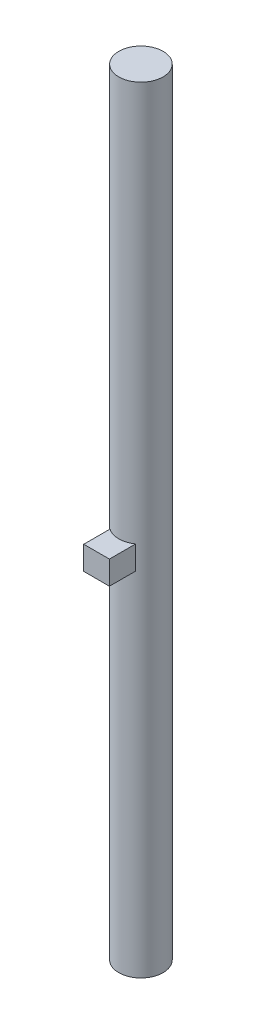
ISO-10303-21;
HEADER;
FILE_DESCRIPTION(('STEP AP214'),'2;1');
FILE_NAME('part.step','',(''),(''),'','','');
FILE_SCHEMA(('AUTOMOTIVE_DESIGN { 1 0 10303 214 1 1 1 1 }'));
ENDSEC;
DATA;
#1=APPLICATION_CONTEXT('core data for automotive mechanical design processes');
#2=APPLICATION_PROTOCOL_DEFINITION('international standard','automotive_design',2000,#1);
#3=PRODUCT_CONTEXT('',#1,'mechanical');
#4=PRODUCT('Part','Part','',(#3));
#5=PRODUCT_RELATED_PRODUCT_CATEGORY('part','',(#4));
#6=PRODUCT_DEFINITION_FORMATION('','',#4);
#7=PRODUCT_DEFINITION_CONTEXT('part definition',#1,'design');
#8=PRODUCT_DEFINITION('design','',#6,#7);
#9=PRODUCT_DEFINITION_SHAPE('','',#8);
#10=(LENGTH_UNIT() NAMED_UNIT(*) SI_UNIT(.MILLI.,.METRE.));
#11=(NAMED_UNIT(*) PLANE_ANGLE_UNIT() SI_UNIT($,.RADIAN.));
#12=(NAMED_UNIT(*) SI_UNIT($,.STERADIAN.) SOLID_ANGLE_UNIT());
#13=UNCERTAINTY_MEASURE_WITH_UNIT(LENGTH_MEASURE(1.E-05),#10,'distance_accuracy_value','');
#14=(GEOMETRIC_REPRESENTATION_CONTEXT(3) GLOBAL_UNCERTAINTY_ASSIGNED_CONTEXT((#13)) GLOBAL_UNIT_ASSIGNED_CONTEXT((#10,
#11,#12)) REPRESENTATION_CONTEXT('',''));
#15=CARTESIAN_POINT('',(0.,0.,0.));
#16=DIRECTION('',(0.,0.,1.));
#17=DIRECTION('',(1.,0.,0.));
#18=AXIS2_PLACEMENT_3D('',#15,#16,#17);
#19=CARTESIAN_POINT('',(0.,35.,0.));
#20=DIRECTION('',(0.,-1.,0.));
#21=DIRECTION('',(0.,0.,-1.));
#22=AXIS2_PLACEMENT_3D('',#19,#20,#21);
#23=CYLINDRICAL_SURFACE('',#22,1.);
#24=CARTESIAN_POINT('',(0.,0.,0.));
#25=DIRECTION('',(0.,1.,0.));
#26=DIRECTION('',(0.,0.,1.));
#27=AXIS2_PLACEMENT_3D('',#24,#25,#26);
#28=CIRCLE('',#27,1.);
#29=CARTESIAN_POINT('',(0.,0.,1.));
#30=VERTEX_POINT('',#29);
#31=EDGE_CURVE('E100',#30,#30,#28,.T.);
#32=ORIENTED_EDGE('',*,*,#31,.T.);
#33=EDGE_LOOP('',(#32));
#34=FACE_BOUND('',#33,.T.);
#35=CARTESIAN_POINT('',(0.,35.,0.));
#36=DIRECTION('',(0.,1.,0.));
#37=DIRECTION('',(0.,0.,1.));
#38=AXIS2_PLACEMENT_3D('',#35,#36,#37);
#39=CIRCLE('',#38,1.);
#40=CARTESIAN_POINT('',(0.,35.,1.));
#41=VERTEX_POINT('',#40);
#42=EDGE_CURVE('E105',#41,#41,#39,.T.);
#43=ORIENTED_EDGE('',*,*,#42,.F.);
#44=EDGE_LOOP('',(#43));
#45=FACE_BOUND('',#44,.T.);
#46=DIRECTION('',(0.,-1.,0.));
#47=VECTOR('',#46,1.);
#48=CARTESIAN_POINT('',(0.579004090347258,35.,0.815324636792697));
#49=LINE('',#48,#47);
#50=CARTESIAN_POINT('',(0.579004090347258,15.8895864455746,0.815324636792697));
#51=VERTEX_POINT('',#50);
#52=CARTESIAN_POINT('',(0.579004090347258,16.9510939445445,0.815324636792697));
#53=VERTEX_POINT('',#52);
#54=EDGE_CURVE('E11',#51,#53,#49,.F.);
#55=ORIENTED_EDGE('',*,*,#54,.F.);
#56=CARTESIAN_POINT('',(0.,15.8895864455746,0.));
#57=DIRECTION('',(0.,1.,0.));
#58=DIRECTION('',(0.,0.,1.));
#59=AXIS2_PLACEMENT_3D('',#56,#57,#58);
#60=CIRCLE('',#59,1.);
#61=CARTESIAN_POINT('',(-0.579004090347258,15.8895864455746,0.815324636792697));
#62=VERTEX_POINT('',#61);
#63=EDGE_CURVE('E113',#62,#51,#60,.T.);
#64=ORIENTED_EDGE('',*,*,#63,.F.);
#65=DIRECTION('',(0.,-1.,0.));
#66=VECTOR('',#65,1.);
#67=CARTESIAN_POINT('',(-0.579004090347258,35.,0.815324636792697));
#68=LINE('',#67,#66);
#69=CARTESIAN_POINT('',(-0.579004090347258,16.9510939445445,0.815324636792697));
#70=VERTEX_POINT('',#69);
#71=EDGE_CURVE('E57',#70,#62,#68,.T.);
#72=ORIENTED_EDGE('',*,*,#71,.F.);
#73=CARTESIAN_POINT('',(0.,16.9510939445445,0.));
#74=DIRECTION('',(0.,-1.,0.));
#75=DIRECTION('',(0.,0.,-1.));
#76=AXIS2_PLACEMENT_3D('',#73,#74,#75);
#77=CIRCLE('',#76,1.);
#78=EDGE_CURVE('E47',#53,#70,#77,.T.);
#79=ORIENTED_EDGE('',*,*,#78,.F.);
#80=EDGE_LOOP('',(#55,#64,#72,#79));
#81=FACE_BOUND('',#80,.T.);
#82=ADVANCED_FACE('F39',(#34,#45,#81),#23,.T.);
#83=CARTESIAN_POINT('',(0.,35.,0.));
#84=DIRECTION('',(0.,1.,0.));
#85=DIRECTION('',(0.,0.,1.));
#86=AXIS2_PLACEMENT_3D('',#83,#84,#85);
#87=PLANE('',#86);
#88=ORIENTED_EDGE('',*,*,#42,.T.);
#89=EDGE_LOOP('',(#88));
#90=FACE_BOUND('',#89,.T.);
#91=ADVANCED_FACE('F135',(#90),#87,.T.);
#92=CARTESIAN_POINT('',(0.,0.,0.));
#93=DIRECTION('',(0.,1.,0.));
#94=DIRECTION('',(0.,0.,1.));
#95=AXIS2_PLACEMENT_3D('',#92,#93,#94);
#96=PLANE('',#95);
#97=ORIENTED_EDGE('',*,*,#31,.F.);
#98=EDGE_LOOP('',(#97));
#99=FACE_BOUND('',#98,.T.);
#100=ADVANCED_FACE('F140',(#99),#96,.F.);
#101=CARTESIAN_POINT('',(0.579004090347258,16.9510939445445,2.));
#102=DIRECTION('',(-1.,0.,0.));
#103=DIRECTION('',(0.,0.,1.));
#104=AXIS2_PLACEMENT_3D('',#101,#102,#103);
#105=PLANE('',#104);
#106=DIRECTION('',(0.,0.,-1.));
#107=VECTOR('',#106,1.);
#108=CARTESIAN_POINT('',(0.579004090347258,15.8895864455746,2.));
#109=LINE('',#108,#107);
#110=CARTESIAN_POINT('',(0.579004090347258,15.8895864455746,2.));
#111=VERTEX_POINT('',#110);
#112=EDGE_CURVE('E127',#111,#51,#109,.T.);
#113=ORIENTED_EDGE('',*,*,#112,.T.);
#114=ORIENTED_EDGE('',*,*,#54,.T.);
#115=DIRECTION('',(0.,0.,-1.));
#116=VECTOR('',#115,1.);
#117=CARTESIAN_POINT('',(0.579004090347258,16.9510939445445,2.));
#118=LINE('',#117,#116);
#119=CARTESIAN_POINT('',(0.579004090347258,16.9510939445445,2.));
#120=VERTEX_POINT('',#119);
#121=EDGE_CURVE('E80',#120,#53,#118,.T.);
#122=ORIENTED_EDGE('',*,*,#121,.F.);
#123=DIRECTION('',(0.,1.,0.));
#124=VECTOR('',#123,1.);
#125=CARTESIAN_POINT('',(0.579004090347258,16.9510939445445,2.));
#126=LINE('',#125,#124);
#127=EDGE_CURVE('E87',#111,#120,#126,.T.);
#128=ORIENTED_EDGE('',*,*,#127,.F.);
#129=EDGE_LOOP('',(#113,#114,#122,#128));
#130=FACE_BOUND('',#129,.T.);
#131=ADVANCED_FACE('F98',(#130),#105,.F.);
#132=CARTESIAN_POINT('',(-0.579004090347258,16.9510939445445,2.));
#133=DIRECTION('',(1.,0.,0.));
#134=DIRECTION('',(0.,0.,-1.));
#135=AXIS2_PLACEMENT_3D('',#132,#133,#134);
#136=PLANE('',#135);
#137=DIRECTION('',(0.,0.,-1.));
#138=VECTOR('',#137,1.);
#139=CARTESIAN_POINT('',(-0.579004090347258,16.9510939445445,2.));
#140=LINE('',#139,#138);
#141=CARTESIAN_POINT('',(-0.579004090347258,16.9510939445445,2.));
#142=VERTEX_POINT('',#141);
#143=EDGE_CURVE('E82',#142,#70,#140,.T.);
#144=ORIENTED_EDGE('',*,*,#143,.T.);
#145=ORIENTED_EDGE('',*,*,#71,.T.);
#146=DIRECTION('',(0.,0.,-1.));
#147=VECTOR('',#146,1.);
#148=CARTESIAN_POINT('',(-0.579004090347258,15.8895864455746,2.));
#149=LINE('',#148,#147);
#150=CARTESIAN_POINT('',(-0.579004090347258,15.8895864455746,2.));
#151=VERTEX_POINT('',#150);
#152=EDGE_CURVE('E107',#151,#62,#149,.T.);
#153=ORIENTED_EDGE('',*,*,#152,.F.);
#154=DIRECTION('',(0.,-1.,0.));
#155=VECTOR('',#154,1.);
#156=CARTESIAN_POINT('',(-0.579004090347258,16.9510939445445,2.));
#157=LINE('',#156,#155);
#158=EDGE_CURVE('E86',#142,#151,#157,.T.);
#159=ORIENTED_EDGE('',*,*,#158,.F.);
#160=EDGE_LOOP('',(#144,#145,#153,#159));
#161=FACE_BOUND('',#160,.T.);
#162=ADVANCED_FACE('F121',(#161),#136,.F.);
#163=CARTESIAN_POINT('',(-0.579004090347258,16.9510939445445,2.));
#164=DIRECTION('',(0.,-1.,0.));
#165=DIRECTION('',(0.,0.,-1.));
#166=AXIS2_PLACEMENT_3D('',#163,#164,#165);
#167=PLANE('',#166);
#168=ORIENTED_EDGE('',*,*,#121,.T.);
#169=ORIENTED_EDGE('',*,*,#78,.T.);
#170=ORIENTED_EDGE('',*,*,#143,.F.);
#171=DIRECTION('',(-1.,0.,0.));
#172=VECTOR('',#171,1.);
#173=CARTESIAN_POINT('',(-0.579004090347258,16.9510939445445,2.));
#174=LINE('',#173,#172);
#175=EDGE_CURVE('E76',#120,#142,#174,.T.);
#176=ORIENTED_EDGE('',*,*,#175,.F.);
#177=EDGE_LOOP('',(#168,#169,#170,#176));
#178=FACE_BOUND('',#177,.T.);
#179=ADVANCED_FACE('F78',(#178),#167,.F.);
#180=CARTESIAN_POINT('',(-0.579004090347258,15.8895864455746,2.));
#181=DIRECTION('',(0.,1.,0.));
#182=DIRECTION('',(0.,0.,1.));
#183=AXIS2_PLACEMENT_3D('',#180,#181,#182);
#184=PLANE('',#183);
#185=ORIENTED_EDGE('',*,*,#152,.T.);
#186=ORIENTED_EDGE('',*,*,#63,.T.);
#187=ORIENTED_EDGE('',*,*,#112,.F.);
#188=DIRECTION('',(1.,0.,0.));
#189=VECTOR('',#188,1.);
#190=CARTESIAN_POINT('',(-0.579004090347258,15.8895864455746,2.));
#191=LINE('',#190,#189);
#192=EDGE_CURVE('E92',#151,#111,#191,.T.);
#193=ORIENTED_EDGE('',*,*,#192,.F.);
#194=EDGE_LOOP('',(#185,#186,#187,#193));
#195=FACE_BOUND('',#194,.T.);
#196=ADVANCED_FACE('F133',(#195),#184,.F.);
#197=CARTESIAN_POINT('',(0.,0.,2.));
#198=DIRECTION('',(0.,0.,1.));
#199=DIRECTION('',(1.,0.,0.));
#200=AXIS2_PLACEMENT_3D('',#197,#198,#199);
#201=PLANE('',#200);
#202=ORIENTED_EDGE('',*,*,#127,.T.);
#203=ORIENTED_EDGE('',*,*,#175,.T.);
#204=ORIENTED_EDGE('',*,*,#158,.T.);
#205=ORIENTED_EDGE('',*,*,#192,.T.);
#206=EDGE_LOOP('',(#202,#203,#204,#205));
#207=FACE_BOUND('',#206,.T.);
#208=ADVANCED_FACE('F90',(#207),#201,.T.);
#209=CLOSED_SHELL('',(#82,#91,#100,#131,#162,#179,#196,#208));
#210=MANIFOLD_SOLID_BREP('B2',#209);
#211=ADVANCED_BREP_SHAPE_REPRESENTATION('',(#18,#210),#14);
#212=SHAPE_DEFINITION_REPRESENTATION(#9,#211);
ENDSEC;
END-ISO-10303-21;
